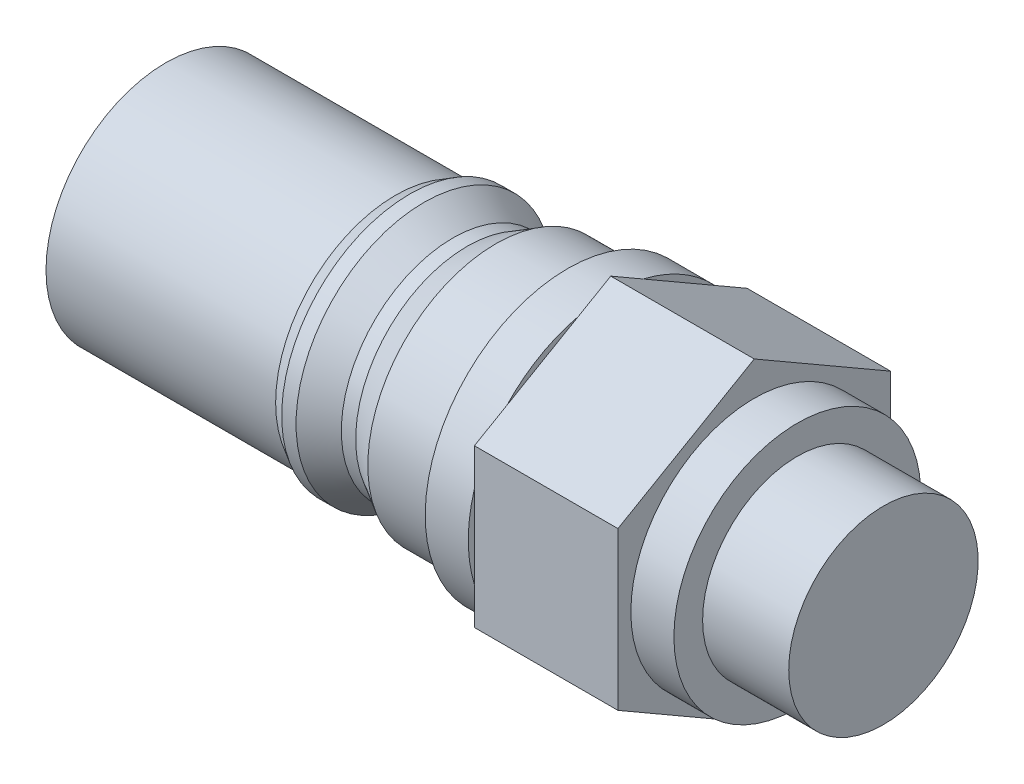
ISO-10303-21;
HEADER;
FILE_DESCRIPTION(('STEP AP214'),'2;1');
FILE_NAME('part.step','',(''),(''),'','','');
FILE_SCHEMA(('AUTOMOTIVE_DESIGN { 1 0 10303 214 1 1 1 1 }'));
ENDSEC;
DATA;
#1=APPLICATION_CONTEXT('core data for automotive mechanical design processes');
#2=APPLICATION_PROTOCOL_DEFINITION('international standard','automotive_design',2000,#1);
#3=PRODUCT_CONTEXT('',#1,'mechanical');
#4=PRODUCT('Part','Part','',(#3));
#5=PRODUCT_RELATED_PRODUCT_CATEGORY('part','',(#4));
#6=PRODUCT_DEFINITION_FORMATION('','',#4);
#7=PRODUCT_DEFINITION_CONTEXT('part definition',#1,'design');
#8=PRODUCT_DEFINITION('design','',#6,#7);
#9=PRODUCT_DEFINITION_SHAPE('','',#8);
#10=(LENGTH_UNIT() NAMED_UNIT(*) SI_UNIT(.MILLI.,.METRE.));
#11=(NAMED_UNIT(*) PLANE_ANGLE_UNIT() SI_UNIT($,.RADIAN.));
#12=(NAMED_UNIT(*) SI_UNIT($,.STERADIAN.) SOLID_ANGLE_UNIT());
#13=UNCERTAINTY_MEASURE_WITH_UNIT(LENGTH_MEASURE(1.E-05),#10,'distance_accuracy_value','');
#14=(GEOMETRIC_REPRESENTATION_CONTEXT(3) GLOBAL_UNCERTAINTY_ASSIGNED_CONTEXT((#13)) GLOBAL_UNIT_ASSIGNED_CONTEXT((#10,
#11,#12)) REPRESENTATION_CONTEXT('',''));
#15=CARTESIAN_POINT('',(0.,0.,0.));
#16=DIRECTION('',(0.,0.,1.));
#17=DIRECTION('',(1.,0.,0.));
#18=AXIS2_PLACEMENT_3D('',#15,#16,#17);
#19=CARTESIAN_POINT('',(31.,9.92735026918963,0.));
#20=DIRECTION('',(1.,0.,0.));
#21=DIRECTION('',(0.,1.,0.));
#22=AXIS2_PLACEMENT_3D('',#19,#20,#21);
#23=PLANE('',#22);
#24=DIRECTION('',(0.,0.5,0.866025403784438));
#25=VECTOR('',#24,1.);
#26=CARTESIAN_POINT('',(31.,5.48482755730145,-9.5));
#27=LINE('',#26,#25);
#28=CARTESIAN_POINT('',(31.,6.78655717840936,-7.24533815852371));
#29=VERTEX_POINT('',#28);
#30=CARTESIAN_POINT('',(31.,9.66792549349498,-2.25466184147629));
#31=VERTEX_POINT('',#30);
#32=EDGE_CURVE('E11',#29,#31,#27,.T.);
#33=ORIENTED_EDGE('',*,*,#32,.F.);
#34=CARTESIAN_POINT('',(31.,0.,0.));
#35=DIRECTION('',(1.,0.,0.));
#36=DIRECTION('',(0.,1.,0.));
#37=AXIS2_PLACEMENT_3D('',#34,#35,#36);
#38=CIRCLE('',#37,9.92735026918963);
#39=EDGE_CURVE('E152',#29,#31,#38,.T.);
#40=ORIENTED_EDGE('',*,*,#39,.T.);
#41=EDGE_LOOP('',(#33,#40));
#42=FACE_BOUND('',#41,.T.);
#43=ADVANCED_FACE('F33',(#42),#23,.T.);
#44=DIRECTION('',(0.,1.,0.));
#45=VECTOR('',#44,1.);
#46=CARTESIAN_POINT('',(31.,-5.48482755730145,-9.5));
#47=LINE('',#46,#45);
#48=CARTESIAN_POINT('',(31.,-2.88136831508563,-9.5));
#49=VERTEX_POINT('',#48);
#50=CARTESIAN_POINT('',(31.,2.88136831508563,-9.5));
#51=VERTEX_POINT('',#50);
#52=EDGE_CURVE('E42',#49,#51,#47,.T.);
#53=ORIENTED_EDGE('',*,*,#52,.F.);
#54=EDGE_CURVE('E339',#49,#51,#38,.T.);
#55=ORIENTED_EDGE('',*,*,#54,.T.);
#56=EDGE_LOOP('',(#53,#55));
#57=FACE_BOUND('',#56,.T.);
#58=ADVANCED_FACE('F249',(#57),#23,.T.);
#59=DIRECTION('',(0.,0.5,-0.866025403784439));
#60=VECTOR('',#59,1.);
#61=CARTESIAN_POINT('',(31.,-10.9696551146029,0.));
#62=LINE('',#61,#60);
#63=CARTESIAN_POINT('',(31.,-9.66792549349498,-2.25466184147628));
#64=VERTEX_POINT('',#63);
#65=CARTESIAN_POINT('',(31.,-6.78655717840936,-7.24533815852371));
#66=VERTEX_POINT('',#65);
#67=EDGE_CURVE('E307',#64,#66,#62,.T.);
#68=ORIENTED_EDGE('',*,*,#67,.F.);
#69=EDGE_CURVE('E330',#64,#66,#38,.T.);
#70=ORIENTED_EDGE('',*,*,#69,.T.);
#71=EDGE_LOOP('',(#68,#70));
#72=FACE_BOUND('',#71,.T.);
#73=ADVANCED_FACE('F255',(#72),#23,.T.);
#74=DIRECTION('',(0.,-0.5,-0.866025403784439));
#75=VECTOR('',#74,1.);
#76=CARTESIAN_POINT('',(31.,-5.48482755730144,9.5));
#77=LINE('',#76,#75);
#78=CARTESIAN_POINT('',(31.,-6.78655717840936,7.24533815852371));
#79=VERTEX_POINT('',#78);
#80=CARTESIAN_POINT('',(31.,-9.66792549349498,2.25466184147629));
#81=VERTEX_POINT('',#80);
#82=EDGE_CURVE('E194',#79,#81,#77,.T.);
#83=ORIENTED_EDGE('',*,*,#82,.F.);
#84=EDGE_CURVE('E325',#79,#81,#38,.T.);
#85=ORIENTED_EDGE('',*,*,#84,.T.);
#86=EDGE_LOOP('',(#83,#85));
#87=FACE_BOUND('',#86,.T.);
#88=ADVANCED_FACE('F275',(#87),#23,.T.);
#89=DIRECTION('',(0.,-1.,0.));
#90=VECTOR('',#89,1.);
#91=CARTESIAN_POINT('',(31.,5.48482755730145,9.5));
#92=LINE('',#91,#90);
#93=CARTESIAN_POINT('',(31.,2.88136831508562,9.5));
#94=VERTEX_POINT('',#93);
#95=CARTESIAN_POINT('',(31.,-2.88136831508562,9.5));
#96=VERTEX_POINT('',#95);
#97=EDGE_CURVE('E189',#94,#96,#92,.T.);
#98=ORIENTED_EDGE('',*,*,#97,.F.);
#99=EDGE_CURVE('E286',#94,#96,#38,.T.);
#100=ORIENTED_EDGE('',*,*,#99,.T.);
#101=EDGE_LOOP('',(#98,#100));
#102=FACE_BOUND('',#101,.T.);
#103=ADVANCED_FACE('F263',(#102),#23,.T.);
#104=CARTESIAN_POINT('',(0.,0.,0.));
#105=DIRECTION('',(-1.,0.,0.));
#106=DIRECTION('',(0.,-1.,0.));
#107=AXIS2_PLACEMENT_3D('',#104,#105,#106);
#108=PLANE('',#107);
#109=CARTESIAN_POINT('',(0.,0.,0.));
#110=DIRECTION('',(1.,0.,0.));
#111=DIRECTION('',(0.,1.,0.));
#112=AXIS2_PLACEMENT_3D('',#109,#110,#111);
#113=CIRCLE('',#112,8.35);
#114=CARTESIAN_POINT('',(0.,8.35,0.));
#115=VERTEX_POINT('',#114);
#116=EDGE_CURVE('E37',#115,#115,#113,.T.);
#117=ORIENTED_EDGE('',*,*,#116,.F.);
#118=EDGE_LOOP('',(#117));
#119=FACE_BOUND('',#118,.T.);
#120=ADVANCED_FACE('F35',(#119),#108,.T.);
#121=CARTESIAN_POINT('',(31.,0.,0.));
#122=DIRECTION('',(1.,0.,0.));
#123=DIRECTION('',(0.,1.,0.));
#124=AXIS2_PLACEMENT_3D('',#121,#122,#123);
#125=CYLINDRICAL_SURFACE('',#124,8.35);
#126=ORIENTED_EDGE('',*,*,#116,.T.);
#127=EDGE_LOOP('',(#126));
#128=FACE_BOUND('',#127,.T.);
#129=CARTESIAN_POINT('',(16.,0.,0.));
#130=DIRECTION('',(1.,0.,0.));
#131=DIRECTION('',(0.,1.,0.));
#132=AXIS2_PLACEMENT_3D('',#129,#130,#131);
#133=CIRCLE('',#132,8.35);
#134=CARTESIAN_POINT('',(16.,8.35,0.));
#135=VERTEX_POINT('',#134);
#136=EDGE_CURVE('E180',#135,#135,#133,.T.);
#137=ORIENTED_EDGE('',*,*,#136,.F.);
#138=EDGE_LOOP('',(#137));
#139=FACE_BOUND('',#138,.T.);
#140=ADVANCED_FACE('F281',(#128,#139),#125,.T.);
#141=CARTESIAN_POINT('',(17.,0.,0.));
#142=DIRECTION('',(1.,0.,0.));
#143=DIRECTION('',(0.,1.,0.));
#144=AXIS2_PLACEMENT_3D('',#141,#142,#143);
#145=CONICAL_SURFACE('',#144,8.92735026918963,0.5235987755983);
#146=ORIENTED_EDGE('',*,*,#136,.T.);
#147=EDGE_LOOP('',(#146));
#148=FACE_BOUND('',#147,.T.);
#149=CARTESIAN_POINT('',(17.,0.,0.));
#150=DIRECTION('',(1.,0.,0.));
#151=DIRECTION('',(0.,1.,0.));
#152=AXIS2_PLACEMENT_3D('',#149,#150,#151);
#153=CIRCLE('',#152,8.92735026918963);
#154=CARTESIAN_POINT('',(17.,8.92735026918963,0.));
#155=VERTEX_POINT('',#154);
#156=EDGE_CURVE('E178',#155,#155,#153,.T.);
#157=ORIENTED_EDGE('',*,*,#156,.F.);
#158=EDGE_LOOP('',(#157));
#159=FACE_BOUND('',#158,.T.);
#160=ADVANCED_FACE('F556',(#148,#159),#145,.T.);
#161=CARTESIAN_POINT('',(31.,0.,0.));
#162=DIRECTION('',(1.,0.,0.));
#163=DIRECTION('',(0.,1.,0.));
#164=AXIS2_PLACEMENT_3D('',#161,#162,#163);
#165=CYLINDRICAL_SURFACE('',#164,8.92735026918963);
#166=ORIENTED_EDGE('',*,*,#156,.T.);
#167=EDGE_LOOP('',(#166));
#168=FACE_BOUND('',#167,.T.);
#169=CARTESIAN_POINT('',(18.,0.,0.));
#170=DIRECTION('',(1.,0.,0.));
#171=DIRECTION('',(0.,1.,0.));
#172=AXIS2_PLACEMENT_3D('',#169,#170,#171);
#173=CIRCLE('',#172,8.92735026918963);
#174=CARTESIAN_POINT('',(18.,8.92735026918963,0.));
#175=VERTEX_POINT('',#174);
#176=EDGE_CURVE('E175',#175,#175,#173,.T.);
#177=ORIENTED_EDGE('',*,*,#176,.F.);
#178=EDGE_LOOP('',(#177));
#179=FACE_BOUND('',#178,.T.);
#180=ADVANCED_FACE('F545',(#168,#179),#165,.T.);
#181=CARTESIAN_POINT('',(20.,0.,0.));
#182=DIRECTION('',(-1.,0.,0.));
#183=DIRECTION('',(0.,-1.,0.));
#184=AXIS2_PLACEMENT_3D('',#181,#182,#183);
#185=CONICAL_SURFACE('',#184,7.77264973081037,0.523598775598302);
#186=ORIENTED_EDGE('',*,*,#176,.T.);
#187=EDGE_LOOP('',(#186));
#188=FACE_BOUND('',#187,.T.);
#189=CARTESIAN_POINT('',(20.,0.,0.));
#190=DIRECTION('',(1.,0.,0.));
#191=DIRECTION('',(0.,1.,0.));
#192=AXIS2_PLACEMENT_3D('',#189,#190,#191);
#193=CIRCLE('',#192,7.77264973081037);
#194=CARTESIAN_POINT('',(20.,7.77264973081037,0.));
#195=VERTEX_POINT('',#194);
#196=EDGE_CURVE('E172',#195,#195,#193,.T.);
#197=ORIENTED_EDGE('',*,*,#196,.F.);
#198=EDGE_LOOP('',(#197));
#199=FACE_BOUND('',#198,.T.);
#200=ADVANCED_FACE('F535',(#188,#199),#185,.T.);
#201=CARTESIAN_POINT('',(31.,0.,0.));
#202=DIRECTION('',(1.,0.,0.));
#203=DIRECTION('',(0.,1.,0.));
#204=AXIS2_PLACEMENT_3D('',#201,#202,#203);
#205=CYLINDRICAL_SURFACE('',#204,7.77264973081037);
#206=ORIENTED_EDGE('',*,*,#196,.T.);
#207=EDGE_LOOP('',(#206));
#208=FACE_BOUND('',#207,.T.);
#209=CARTESIAN_POINT('',(21.,0.,0.));
#210=DIRECTION('',(1.,0.,0.));
#211=DIRECTION('',(0.,1.,0.));
#212=AXIS2_PLACEMENT_3D('',#209,#210,#211);
#213=CIRCLE('',#212,7.77264973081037);
#214=CARTESIAN_POINT('',(21.,7.77264973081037,0.));
#215=VERTEX_POINT('',#214);
#216=EDGE_CURVE('E169',#215,#215,#213,.T.);
#217=ORIENTED_EDGE('',*,*,#216,.F.);
#218=EDGE_LOOP('',(#217));
#219=FACE_BOUND('',#218,.T.);
#220=ADVANCED_FACE('F523',(#208,#219),#205,.T.);
#221=CARTESIAN_POINT('',(23.,0.,0.));
#222=DIRECTION('',(1.,0.,0.));
#223=DIRECTION('',(0.,1.,0.));
#224=AXIS2_PLACEMENT_3D('',#221,#222,#223);
#225=CONICAL_SURFACE('',#224,8.92735026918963,0.5235987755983);
#226=ORIENTED_EDGE('',*,*,#216,.T.);
#227=EDGE_LOOP('',(#226));
#228=FACE_BOUND('',#227,.T.);
#229=CARTESIAN_POINT('',(23.,0.,0.));
#230=DIRECTION('',(1.,0.,0.));
#231=DIRECTION('',(0.,1.,0.));
#232=AXIS2_PLACEMENT_3D('',#229,#230,#231);
#233=CIRCLE('',#232,8.92735026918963);
#234=CARTESIAN_POINT('',(23.,8.92735026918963,0.));
#235=VERTEX_POINT('',#234);
#236=EDGE_CURVE('E166',#235,#235,#233,.T.);
#237=ORIENTED_EDGE('',*,*,#236,.F.);
#238=EDGE_LOOP('',(#237));
#239=FACE_BOUND('',#238,.T.);
#240=ADVANCED_FACE('F514',(#228,#239),#225,.T.);
#241=CARTESIAN_POINT('',(31.,0.,0.));
#242=DIRECTION('',(1.,0.,0.));
#243=DIRECTION('',(0.,1.,0.));
#244=AXIS2_PLACEMENT_3D('',#241,#242,#243);
#245=CYLINDRICAL_SURFACE('',#244,8.92735026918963);
#246=ORIENTED_EDGE('',*,*,#236,.T.);
#247=EDGE_LOOP('',(#246));
#248=FACE_BOUND('',#247,.T.);
#249=CARTESIAN_POINT('',(28.,0.,0.));
#250=DIRECTION('',(1.,0.,0.));
#251=DIRECTION('',(0.,1.,0.));
#252=AXIS2_PLACEMENT_3D('',#249,#250,#251);
#253=CIRCLE('',#252,8.92735026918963);
#254=CARTESIAN_POINT('',(28.,8.92735026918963,0.));
#255=VERTEX_POINT('',#254);
#256=EDGE_CURVE('E163',#255,#255,#253,.T.);
#257=ORIENTED_EDGE('',*,*,#256,.F.);
#258=EDGE_LOOP('',(#257));
#259=FACE_BOUND('',#258,.T.);
#260=ADVANCED_FACE('F505',(#248,#259),#245,.T.);
#261=CARTESIAN_POINT('',(28.,8.92735026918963,0.));
#262=DIRECTION('',(-1.,0.,0.));
#263=DIRECTION('',(0.,-1.,0.));
#264=AXIS2_PLACEMENT_3D('',#261,#262,#263);
#265=PLANE('',#264);
#266=ORIENTED_EDGE('',*,*,#256,.T.);
#267=EDGE_LOOP('',(#266));
#268=FACE_BOUND('',#267,.T.);
#269=CARTESIAN_POINT('',(28.,0.,0.));
#270=DIRECTION('',(1.,0.,0.));
#271=DIRECTION('',(0.,1.,0.));
#272=AXIS2_PLACEMENT_3D('',#269,#270,#271);
#273=CIRCLE('',#272,9.92735026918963);
#274=CARTESIAN_POINT('',(28.,9.92735026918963,0.));
#275=VERTEX_POINT('',#274);
#276=EDGE_CURVE('E159',#275,#275,#273,.T.);
#277=ORIENTED_EDGE('',*,*,#276,.F.);
#278=EDGE_LOOP('',(#277));
#279=FACE_BOUND('',#278,.T.);
#280=ADVANCED_FACE('F272',(#268,#279),#265,.T.);
#281=CARTESIAN_POINT('',(31.,0.,0.));
#282=DIRECTION('',(1.,0.,0.));
#283=DIRECTION('',(0.,1.,0.));
#284=AXIS2_PLACEMENT_3D('',#281,#282,#283);
#285=CYLINDRICAL_SURFACE('',#284,9.92735026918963);
#286=ORIENTED_EDGE('',*,*,#276,.T.);
#287=EDGE_LOOP('',(#286));
#288=FACE_BOUND('',#287,.T.);
#289=CARTESIAN_POINT('',(31.,9.66792549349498,2.2546618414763));
#290=VERTEX_POINT('',#289);
#291=CARTESIAN_POINT('',(31.,6.78655717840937,7.2453381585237));
#292=VERTEX_POINT('',#291);
#293=EDGE_CURVE('E154',#290,#292,#38,.T.);
#294=ORIENTED_EDGE('',*,*,#293,.F.);
#295=EDGE_CURVE('E52',#31,#290,#38,.T.);
#296=ORIENTED_EDGE('',*,*,#295,.F.);
#297=ORIENTED_EDGE('',*,*,#39,.F.);
#298=EDGE_CURVE('E343',#51,#29,#38,.T.);
#299=ORIENTED_EDGE('',*,*,#298,.F.);
#300=ORIENTED_EDGE('',*,*,#54,.F.);
#301=EDGE_CURVE('E334',#66,#49,#38,.T.);
#302=ORIENTED_EDGE('',*,*,#301,.F.);
#303=ORIENTED_EDGE('',*,*,#69,.F.);
#304=EDGE_CURVE('E327',#81,#64,#38,.T.);
#305=ORIENTED_EDGE('',*,*,#304,.F.);
#306=ORIENTED_EDGE('',*,*,#84,.F.);
#307=EDGE_CURVE('E294',#96,#79,#38,.T.);
#308=ORIENTED_EDGE('',*,*,#307,.F.);
#309=ORIENTED_EDGE('',*,*,#99,.F.);
#310=EDGE_CURVE('E160',#292,#94,#38,.T.);
#311=ORIENTED_EDGE('',*,*,#310,.F.);
#312=EDGE_LOOP('',(#294,#296,#297,#299,#300,#302,#303,#305,#306,#308,#309,#311));
#313=FACE_BOUND('',#312,.T.);
#314=ADVANCED_FACE('F261',(#288,#313),#285,.T.);
#315=DIRECTION('',(0.,-0.5,0.866025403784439));
#316=VECTOR('',#315,1.);
#317=CARTESIAN_POINT('',(31.,10.9696551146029,0.));
#318=LINE('',#317,#316);
#319=EDGE_CURVE('E185',#290,#292,#318,.T.);
#320=ORIENTED_EDGE('',*,*,#319,.F.);
#321=ORIENTED_EDGE('',*,*,#293,.T.);
#322=EDGE_LOOP('',(#320,#321));
#323=FACE_BOUND('',#322,.T.);
#324=ADVANCED_FACE('F251',(#323),#23,.T.);
#325=CARTESIAN_POINT('',(31.,0.,0.));
#326=DIRECTION('',(1.,0.,0.));
#327=DIRECTION('',(0.,0.,-1.));
#328=AXIS2_PLACEMENT_3D('',#325,#326,#327);
#329=PLANE('',#328);
#330=CARTESIAN_POINT('',(31.,5.48482755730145,9.5));
#331=VERTEX_POINT('',#330);
#332=EDGE_CURVE('E192',#292,#331,#318,.T.);
#333=ORIENTED_EDGE('',*,*,#332,.F.);
#334=ORIENTED_EDGE('',*,*,#310,.T.);
#335=EDGE_CURVE('E196',#331,#94,#92,.T.);
#336=ORIENTED_EDGE('',*,*,#335,.F.);
#337=EDGE_LOOP('',(#333,#334,#336));
#338=FACE_BOUND('',#337,.T.);
#339=ADVANCED_FACE('F260',(#338),#329,.F.);
#340=CARTESIAN_POINT('',(31.,-5.48482755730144,9.5));
#341=VERTEX_POINT('',#340);
#342=EDGE_CURVE('E197',#96,#341,#92,.T.);
#343=ORIENTED_EDGE('',*,*,#342,.F.);
#344=ORIENTED_EDGE('',*,*,#307,.T.);
#345=EDGE_CURVE('E298',#341,#79,#77,.T.);
#346=ORIENTED_EDGE('',*,*,#345,.F.);
#347=EDGE_LOOP('',(#343,#344,#346));
#348=FACE_BOUND('',#347,.T.);
#349=ADVANCED_FACE('F268',(#348),#329,.F.);
#350=CARTESIAN_POINT('',(31.,-10.9696551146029,0.));
#351=VERTEX_POINT('',#350);
#352=EDGE_CURVE('E297',#81,#351,#77,.T.);
#353=ORIENTED_EDGE('',*,*,#352,.F.);
#354=ORIENTED_EDGE('',*,*,#304,.T.);
#355=EDGE_CURVE('E303',#351,#64,#62,.T.);
#356=ORIENTED_EDGE('',*,*,#355,.F.);
#357=EDGE_LOOP('',(#353,#354,#356));
#358=FACE_BOUND('',#357,.T.);
#359=ADVANCED_FACE('F448',(#358),#329,.F.);
#360=CARTESIAN_POINT('',(31.,-5.48482755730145,-9.5));
#361=VERTEX_POINT('',#360);
#362=EDGE_CURVE('E302',#66,#361,#62,.T.);
#363=ORIENTED_EDGE('',*,*,#362,.F.);
#364=ORIENTED_EDGE('',*,*,#301,.T.);
#365=EDGE_CURVE('E145',#361,#49,#47,.T.);
#366=ORIENTED_EDGE('',*,*,#365,.F.);
#367=EDGE_LOOP('',(#363,#364,#366));
#368=FACE_BOUND('',#367,.T.);
#369=ADVANCED_FACE('F355',(#368),#329,.F.);
#370=CARTESIAN_POINT('',(31.,5.48482755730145,-9.5));
#371=VERTEX_POINT('',#370);
#372=EDGE_CURVE('E306',#51,#371,#47,.T.);
#373=ORIENTED_EDGE('',*,*,#372,.F.);
#374=ORIENTED_EDGE('',*,*,#298,.T.);
#375=EDGE_CURVE('E44',#371,#29,#27,.T.);
#376=ORIENTED_EDGE('',*,*,#375,.F.);
#377=EDGE_LOOP('',(#373,#374,#376));
#378=FACE_BOUND('',#377,.T.);
#379=ADVANCED_FACE('F350',(#378),#329,.F.);
#380=CARTESIAN_POINT('',(31.,10.9696551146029,0.));
#381=VERTEX_POINT('',#380);
#382=EDGE_CURVE('E45',#31,#381,#27,.T.);
#383=ORIENTED_EDGE('',*,*,#382,.F.);
#384=ORIENTED_EDGE('',*,*,#295,.T.);
#385=EDGE_CURVE('E191',#381,#290,#318,.T.);
#386=ORIENTED_EDGE('',*,*,#385,.F.);
#387=EDGE_LOOP('',(#383,#384,#386));
#388=FACE_BOUND('',#387,.T.);
#389=ADVANCED_FACE('F271',(#388),#329,.F.);
#390=CARTESIAN_POINT('',(41.,5.48482755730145,-9.5));
#391=DIRECTION('',(0.,-0.866025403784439,0.5));
#392=DIRECTION('',(0.,-0.5,-0.866025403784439));
#393=AXIS2_PLACEMENT_3D('',#390,#391,#392);
#394=PLANE('',#393);
#395=ORIENTED_EDGE('',*,*,#375,.T.);
#396=ORIENTED_EDGE('',*,*,#32,.T.);
#397=ORIENTED_EDGE('',*,*,#382,.T.);
#398=DIRECTION('',(-1.,0.,0.));
#399=VECTOR('',#398,1.);
#400=CARTESIAN_POINT('',(41.,10.9696551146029,0.));
#401=LINE('',#400,#399);
#402=CARTESIAN_POINT('',(41.,10.9696551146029,0.));
#403=VERTEX_POINT('',#402);
#404=EDGE_CURVE('E130',#403,#381,#401,.T.);
#405=ORIENTED_EDGE('',*,*,#404,.F.);
#406=DIRECTION('',(0.,0.5,0.866025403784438));
#407=VECTOR('',#406,1.);
#408=CARTESIAN_POINT('',(41.,5.48482755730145,-9.5));
#409=LINE('',#408,#407);
#410=CARTESIAN_POINT('',(41.,5.48482755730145,-9.5));
#411=VERTEX_POINT('',#410);
#412=EDGE_CURVE('E136',#411,#403,#409,.T.);
#413=ORIENTED_EDGE('',*,*,#412,.F.);
#414=DIRECTION('',(-1.,0.,0.));
#415=VECTOR('',#414,1.);
#416=CARTESIAN_POINT('',(41.,5.48482755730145,-9.5));
#417=LINE('',#416,#415);
#418=EDGE_CURVE('E203',#411,#371,#417,.T.);
#419=ORIENTED_EDGE('',*,*,#418,.T.);
#420=EDGE_LOOP('',(#395,#396,#397,#405,#413,#419));
#421=FACE_BOUND('',#420,.T.);
#422=ADVANCED_FACE('F148',(#421),#394,.F.);
#423=CARTESIAN_POINT('',(41.,10.9696551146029,0.));
#424=DIRECTION('',(0.,-0.866025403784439,-0.5));
#425=DIRECTION('',(0.,0.5,-0.866025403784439));
#426=AXIS2_PLACEMENT_3D('',#423,#424,#425);
#427=PLANE('',#426);
#428=ORIENTED_EDGE('',*,*,#385,.T.);
#429=ORIENTED_EDGE('',*,*,#319,.T.);
#430=ORIENTED_EDGE('',*,*,#332,.T.);
#431=DIRECTION('',(-1.,0.,0.));
#432=VECTOR('',#431,1.);
#433=CARTESIAN_POINT('',(41.,5.48482755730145,9.5));
#434=LINE('',#433,#432);
#435=CARTESIAN_POINT('',(41.,5.48482755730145,9.5));
#436=VERTEX_POINT('',#435);
#437=EDGE_CURVE('E132',#436,#331,#434,.T.);
#438=ORIENTED_EDGE('',*,*,#437,.F.);
#439=DIRECTION('',(0.,-0.5,0.866025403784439));
#440=VECTOR('',#439,1.);
#441=CARTESIAN_POINT('',(41.,10.9696551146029,0.));
#442=LINE('',#441,#440);
#443=EDGE_CURVE('E125',#403,#436,#442,.T.);
#444=ORIENTED_EDGE('',*,*,#443,.F.);
#445=ORIENTED_EDGE('',*,*,#404,.T.);
#446=EDGE_LOOP('',(#428,#429,#430,#438,#444,#445));
#447=FACE_BOUND('',#446,.T.);
#448=ADVANCED_FACE('F128',(#447),#427,.F.);
#449=CARTESIAN_POINT('',(41.,5.48482755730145,9.5));
#450=DIRECTION('',(0.,0.,-1.));
#451=DIRECTION('',(-1.,0.,0.));
#452=AXIS2_PLACEMENT_3D('',#449,#450,#451);
#453=PLANE('',#452);
#454=ORIENTED_EDGE('',*,*,#335,.T.);
#455=ORIENTED_EDGE('',*,*,#97,.T.);
#456=ORIENTED_EDGE('',*,*,#342,.T.);
#457=DIRECTION('',(-1.,0.,0.));
#458=VECTOR('',#457,1.);
#459=CARTESIAN_POINT('',(41.,-5.48482755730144,9.5));
#460=LINE('',#459,#458);
#461=CARTESIAN_POINT('',(41.,-5.48482755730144,9.5));
#462=VERTEX_POINT('',#461);
#463=EDGE_CURVE('E155',#462,#341,#460,.T.);
#464=ORIENTED_EDGE('',*,*,#463,.F.);
#465=DIRECTION('',(0.,-1.,0.));
#466=VECTOR('',#465,1.);
#467=CARTESIAN_POINT('',(41.,5.48482755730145,9.5));
#468=LINE('',#467,#466);
#469=EDGE_CURVE('E135',#436,#462,#468,.T.);
#470=ORIENTED_EDGE('',*,*,#469,.F.);
#471=ORIENTED_EDGE('',*,*,#437,.T.);
#472=EDGE_LOOP('',(#454,#455,#456,#464,#470,#471));
#473=FACE_BOUND('',#472,.T.);
#474=ADVANCED_FACE('F296',(#473),#453,.F.);
#475=CARTESIAN_POINT('',(41.,-5.48482755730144,9.5));
#476=DIRECTION('',(0.,0.866025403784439,-0.5));
#477=DIRECTION('',(0.,0.5,0.866025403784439));
#478=AXIS2_PLACEMENT_3D('',#475,#476,#477);
#479=PLANE('',#478);
#480=ORIENTED_EDGE('',*,*,#345,.T.);
#481=ORIENTED_EDGE('',*,*,#82,.T.);
#482=ORIENTED_EDGE('',*,*,#352,.T.);
#483=DIRECTION('',(-1.,0.,0.));
#484=VECTOR('',#483,1.);
#485=CARTESIAN_POINT('',(41.,-10.9696551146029,0.));
#486=LINE('',#485,#484);
#487=CARTESIAN_POINT('',(41.,-10.9696551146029,0.));
#488=VERTEX_POINT('',#487);
#489=EDGE_CURVE('E314',#488,#351,#486,.T.);
#490=ORIENTED_EDGE('',*,*,#489,.F.);
#491=DIRECTION('',(0.,-0.5,-0.866025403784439));
#492=VECTOR('',#491,1.);
#493=CARTESIAN_POINT('',(41.,-5.48482755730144,9.5));
#494=LINE('',#493,#492);
#495=EDGE_CURVE('E206',#462,#488,#494,.T.);
#496=ORIENTED_EDGE('',*,*,#495,.F.);
#497=ORIENTED_EDGE('',*,*,#463,.T.);
#498=EDGE_LOOP('',(#480,#481,#482,#490,#496,#497));
#499=FACE_BOUND('',#498,.T.);
#500=ADVANCED_FACE('F321',(#499),#479,.F.);
#501=CARTESIAN_POINT('',(41.,-10.9696551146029,0.));
#502=DIRECTION('',(0.,0.866025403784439,0.5));
#503=DIRECTION('',(0.,-0.5,0.866025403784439));
#504=AXIS2_PLACEMENT_3D('',#501,#502,#503);
#505=PLANE('',#504);
#506=ORIENTED_EDGE('',*,*,#355,.T.);
#507=ORIENTED_EDGE('',*,*,#67,.T.);
#508=ORIENTED_EDGE('',*,*,#362,.T.);
#509=DIRECTION('',(-1.,0.,0.));
#510=VECTOR('',#509,1.);
#511=CARTESIAN_POINT('',(41.,-5.48482755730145,-9.5));
#512=LINE('',#511,#510);
#513=CARTESIAN_POINT('',(41.,-5.48482755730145,-9.5));
#514=VERTEX_POINT('',#513);
#515=EDGE_CURVE('E311',#514,#361,#512,.T.);
#516=ORIENTED_EDGE('',*,*,#515,.F.);
#517=DIRECTION('',(0.,0.5,-0.866025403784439));
#518=VECTOR('',#517,1.);
#519=CARTESIAN_POINT('',(41.,-10.9696551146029,0.));
#520=LINE('',#519,#518);
#521=EDGE_CURVE('E204',#488,#514,#520,.T.);
#522=ORIENTED_EDGE('',*,*,#521,.F.);
#523=ORIENTED_EDGE('',*,*,#489,.T.);
#524=EDGE_LOOP('',(#506,#507,#508,#516,#522,#523));
#525=FACE_BOUND('',#524,.T.);
#526=ADVANCED_FACE('F359',(#525),#505,.F.);
#527=CARTESIAN_POINT('',(41.,-5.48482755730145,-9.5));
#528=DIRECTION('',(0.,0.,1.));
#529=DIRECTION('',(0.,-1.,0.));
#530=AXIS2_PLACEMENT_3D('',#527,#528,#529);
#531=PLANE('',#530);
#532=ORIENTED_EDGE('',*,*,#365,.T.);
#533=ORIENTED_EDGE('',*,*,#52,.T.);
#534=ORIENTED_EDGE('',*,*,#372,.T.);
#535=ORIENTED_EDGE('',*,*,#418,.F.);
#536=DIRECTION('',(0.,1.,0.));
#537=VECTOR('',#536,1.);
#538=CARTESIAN_POINT('',(41.,-5.48482755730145,-9.5));
#539=LINE('',#538,#537);
#540=EDGE_CURVE('E141',#514,#411,#539,.T.);
#541=ORIENTED_EDGE('',*,*,#540,.F.);
#542=ORIENTED_EDGE('',*,*,#515,.T.);
#543=EDGE_LOOP('',(#532,#533,#534,#535,#541,#542));
#544=FACE_BOUND('',#543,.T.);
#545=ADVANCED_FACE('F246',(#544),#531,.F.);
#546=CARTESIAN_POINT('',(41.,0.,0.));
#547=DIRECTION('',(1.,0.,0.));
#548=DIRECTION('',(0.,0.,-1.));
#549=AXIS2_PLACEMENT_3D('',#546,#547,#548);
#550=PLANE('',#549);
#551=CARTESIAN_POINT('',(41.,0.,0.));
#552=DIRECTION('',(-1.,0.,0.));
#553=DIRECTION('',(0.,0.,1.));
#554=AXIS2_PLACEMENT_3D('',#551,#552,#553);
#555=CIRCLE('',#554,8.6);
#556=CARTESIAN_POINT('',(41.,0.,8.6));
#557=VERTEX_POINT('',#556);
#558=EDGE_CURVE('E217',#557,#557,#555,.T.);
#559=ORIENTED_EDGE('',*,*,#558,.T.);
#560=EDGE_LOOP('',(#559));
#561=FACE_BOUND('',#560,.T.);
#562=ORIENTED_EDGE('',*,*,#412,.T.);
#563=ORIENTED_EDGE('',*,*,#443,.T.);
#564=ORIENTED_EDGE('',*,*,#469,.T.);
#565=ORIENTED_EDGE('',*,*,#495,.T.);
#566=ORIENTED_EDGE('',*,*,#521,.T.);
#567=ORIENTED_EDGE('',*,*,#540,.T.);
#568=EDGE_LOOP('',(#562,#563,#564,#565,#566,#567));
#569=FACE_BOUND('',#568,.T.);
#570=ADVANCED_FACE('F139',(#561,#569),#550,.T.);
#571=CARTESIAN_POINT('',(50.,0.,0.));
#572=DIRECTION('',(-1.,0.,0.));
#573=DIRECTION('',(0.,0.,1.));
#574=AXIS2_PLACEMENT_3D('',#571,#572,#573);
#575=PLANE('',#574);
#576=CARTESIAN_POINT('',(50.,0.,0.));
#577=DIRECTION('',(-1.,0.,0.));
#578=DIRECTION('',(0.,0.,1.));
#579=AXIS2_PLACEMENT_3D('',#576,#577,#578);
#580=CIRCLE('',#579,6.6);
#581=CARTESIAN_POINT('',(50.,0.,6.6));
#582=VERTEX_POINT('',#581);
#583=EDGE_CURVE('E200',#582,#582,#580,.T.);
#584=ORIENTED_EDGE('',*,*,#583,.F.);
#585=EDGE_LOOP('',(#584));
#586=FACE_BOUND('',#585,.T.);
#587=ADVANCED_FACE('F237',(#586),#575,.F.);
#588=CARTESIAN_POINT('',(41.,0.,0.));
#589=DIRECTION('',(-1.,0.,0.));
#590=DIRECTION('',(0.,0.,1.));
#591=AXIS2_PLACEMENT_3D('',#588,#589,#590);
#592=CYLINDRICAL_SURFACE('',#591,6.6);
#593=CARTESIAN_POINT('',(44.,0.,0.));
#594=DIRECTION('',(-1.,0.,0.));
#595=DIRECTION('',(0.,0.,1.));
#596=AXIS2_PLACEMENT_3D('',#593,#594,#595);
#597=CIRCLE('',#596,6.6);
#598=CARTESIAN_POINT('',(44.,0.,6.6));
#599=VERTEX_POINT('',#598);
#600=EDGE_CURVE('E211',#599,#599,#597,.T.);
#601=ORIENTED_EDGE('',*,*,#600,.F.);
#602=EDGE_LOOP('',(#601));
#603=FACE_BOUND('',#602,.T.);
#604=ORIENTED_EDGE('',*,*,#583,.T.);
#605=EDGE_LOOP('',(#604));
#606=FACE_BOUND('',#605,.T.);
#607=ADVANCED_FACE('F231',(#603,#606),#592,.T.);
#608=CARTESIAN_POINT('',(44.,6.6,0.));
#609=DIRECTION('',(-1.,0.,0.));
#610=DIRECTION('',(0.,0.,1.));
#611=AXIS2_PLACEMENT_3D('',#608,#609,#610);
#612=PLANE('',#611);
#613=CARTESIAN_POINT('',(44.,0.,0.));
#614=DIRECTION('',(-1.,0.,0.));
#615=DIRECTION('',(0.,0.,1.));
#616=AXIS2_PLACEMENT_3D('',#613,#614,#615);
#617=CIRCLE('',#616,8.6);
#618=CARTESIAN_POINT('',(44.,0.,8.6));
#619=VERTEX_POINT('',#618);
#620=EDGE_CURVE('E214',#619,#619,#617,.T.);
#621=ORIENTED_EDGE('',*,*,#620,.F.);
#622=EDGE_LOOP('',(#621));
#623=FACE_BOUND('',#622,.T.);
#624=ORIENTED_EDGE('',*,*,#600,.T.);
#625=EDGE_LOOP('',(#624));
#626=FACE_BOUND('',#625,.T.);
#627=ADVANCED_FACE('F225',(#623,#626),#612,.F.);
#628=CARTESIAN_POINT('',(41.,0.,0.));
#629=DIRECTION('',(-1.,0.,0.));
#630=DIRECTION('',(0.,0.,1.));
#631=AXIS2_PLACEMENT_3D('',#628,#629,#630);
#632=CYLINDRICAL_SURFACE('',#631,8.6);
#633=ORIENTED_EDGE('',*,*,#558,.F.);
#634=EDGE_LOOP('',(#633));
#635=FACE_BOUND('',#634,.T.);
#636=ORIENTED_EDGE('',*,*,#620,.T.);
#637=EDGE_LOOP('',(#636));
#638=FACE_BOUND('',#637,.T.);
#639=ADVANCED_FACE('F222',(#635,#638),#632,.T.);
#640=CLOSED_SHELL('',(#43,#58,#73,#88,#103,#120,#140,#160,#180,#200,#220,#240,#260,#280,#314,
#324,#339,#349,#359,#369,#379,#389,#422,#448,#474,#500,#526,#545,#570,#587,#607,#627,#639));
#641=MANIFOLD_SOLID_BREP('B2',#640);
#642=ADVANCED_BREP_SHAPE_REPRESENTATION('',(#18,#641),#14);
#643=SHAPE_DEFINITION_REPRESENTATION(#9,#642);
ENDSEC;
END-ISO-10303-21;
